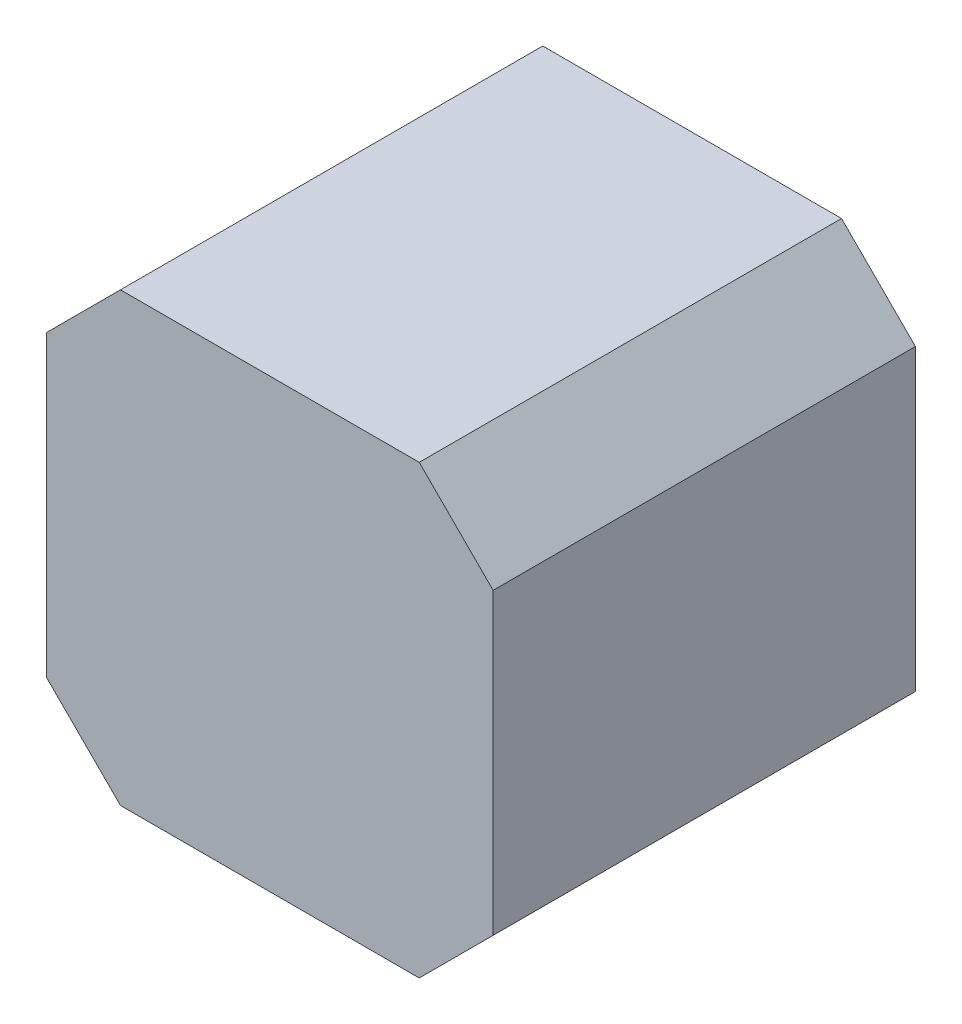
from build123d import *

# Parameters (mm, degrees)
EXTRUDE1_DEPTH = 40


with BuildPart() as part:
    # Sketch1 → Extrude1 (new body)
    with BuildSketch(Plane.XY):
        Polygon((-14.15, 21.15), (-21.15, 14.15), (-21.15, -14.15), (-14.15, -21.15), (14.15, -21.15), (21.15, -14.15), (21.15, 14.15), (14.15, 21.15), align=None)
    extrude(amount=EXTRUDE1_DEPTH)


solid = part.part
